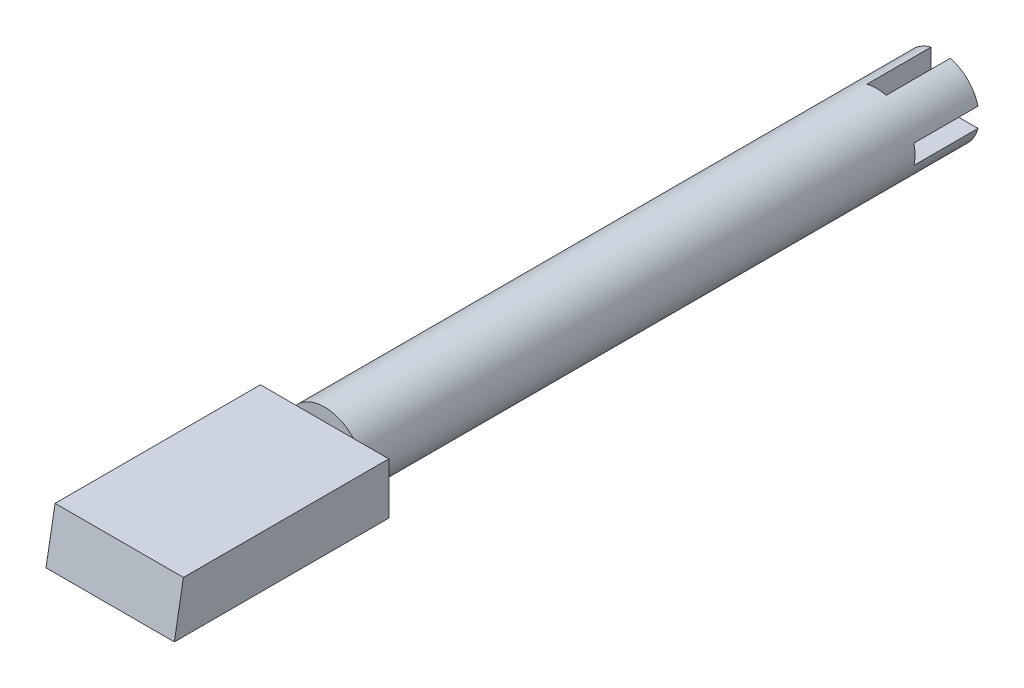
ISO-10303-21;
HEADER;
FILE_DESCRIPTION(('STEP AP214'),'2;1');
FILE_NAME('part.step','',(''),(''),'','','');
FILE_SCHEMA(('AUTOMOTIVE_DESIGN { 1 0 10303 214 1 1 1 1 }'));
ENDSEC;
DATA;
#1=APPLICATION_CONTEXT('core data for automotive mechanical design processes');
#2=APPLICATION_PROTOCOL_DEFINITION('international standard','automotive_design',2000,#1);
#3=PRODUCT_CONTEXT('',#1,'mechanical');
#4=PRODUCT('Part','Part','',(#3));
#5=PRODUCT_RELATED_PRODUCT_CATEGORY('part','',(#4));
#6=PRODUCT_DEFINITION_FORMATION('','',#4);
#7=PRODUCT_DEFINITION_CONTEXT('part definition',#1,'design');
#8=PRODUCT_DEFINITION('design','',#6,#7);
#9=PRODUCT_DEFINITION_SHAPE('','',#8);
#10=(LENGTH_UNIT() NAMED_UNIT(*) SI_UNIT(.MILLI.,.METRE.));
#11=(NAMED_UNIT(*) PLANE_ANGLE_UNIT() SI_UNIT($,.RADIAN.));
#12=(NAMED_UNIT(*) SI_UNIT($,.STERADIAN.) SOLID_ANGLE_UNIT());
#13=UNCERTAINTY_MEASURE_WITH_UNIT(LENGTH_MEASURE(1.E-05),#10,'distance_accuracy_value','');
#14=(GEOMETRIC_REPRESENTATION_CONTEXT(3) GLOBAL_UNCERTAINTY_ASSIGNED_CONTEXT((#13)) GLOBAL_UNIT_ASSIGNED_CONTEXT((#10,
#11,#12)) REPRESENTATION_CONTEXT('',''));
#15=CARTESIAN_POINT('',(0.,0.,0.));
#16=DIRECTION('',(0.,0.,1.));
#17=DIRECTION('',(1.,0.,0.));
#18=AXIS2_PLACEMENT_3D('',#15,#16,#17);
#19=CARTESIAN_POINT('',(0.,0.,48.));
#20=DIRECTION('',(0.,0.,-1.));
#21=DIRECTION('',(-1.,0.,0.));
#22=AXIS2_PLACEMENT_3D('',#19,#20,#21);
#23=CYLINDRICAL_SURFACE('',#22,3.);
#24=CARTESIAN_POINT('',(0.,0.,48.));
#25=DIRECTION('',(0.,0.,1.));
#26=DIRECTION('',(1.,0.,0.));
#27=AXIS2_PLACEMENT_3D('',#24,#25,#26);
#28=CIRCLE('',#27,3.);
#29=CARTESIAN_POINT('',(2.23606797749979,2.,48.));
#30=VERTEX_POINT('',#29);
#31=CARTESIAN_POINT('',(-2.23606797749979,2.,48.));
#32=VERTEX_POINT('',#31);
#33=EDGE_CURVE('E279',#30,#32,#28,.T.);
#34=ORIENTED_EDGE('',*,*,#33,.F.);
#35=CARTESIAN_POINT('',(2.23606797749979,-2.,48.));
#36=VERTEX_POINT('',#35);
#37=EDGE_CURVE('E282',#36,#30,#28,.T.);
#38=ORIENTED_EDGE('',*,*,#37,.F.);
#39=CARTESIAN_POINT('',(-2.23606797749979,-2.,48.));
#40=VERTEX_POINT('',#39);
#41=EDGE_CURVE('E287',#40,#36,#28,.T.);
#42=ORIENTED_EDGE('',*,*,#41,.F.);
#43=EDGE_CURVE('E281',#32,#40,#28,.T.);
#44=ORIENTED_EDGE('',*,*,#43,.F.);
#45=EDGE_LOOP('',(#34,#38,#42,#44));
#46=FACE_BOUND('',#45,.T.);
#47=CARTESIAN_POINT('',(0.,0.,0.));
#48=DIRECTION('',(0.,0.,1.));
#49=DIRECTION('',(1.,0.,0.));
#50=AXIS2_PLACEMENT_3D('',#47,#48,#49);
#51=CIRCLE('',#50,3.);
#52=CARTESIAN_POINT('',(2.90473750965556,0.75,0.));
#53=VERTEX_POINT('',#52);
#54=CARTESIAN_POINT('',(0.750000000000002,2.90473750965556,0.));
#55=VERTEX_POINT('',#54);
#56=EDGE_CURVE('E37',#53,#55,#51,.T.);
#57=ORIENTED_EDGE('',*,*,#56,.T.);
#58=DIRECTION('',(0.,0.,-1.));
#59=VECTOR('',#58,1.);
#60=CARTESIAN_POINT('',(0.750000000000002,2.90473750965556,5.));
#61=LINE('',#60,#59);
#62=CARTESIAN_POINT('',(0.750000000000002,2.90473750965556,5.));
#63=VERTEX_POINT('',#62);
#64=EDGE_CURVE('E227',#63,#55,#61,.T.);
#65=ORIENTED_EDGE('',*,*,#64,.F.);
#66=CARTESIAN_POINT('',(0.,0.,5.));
#67=DIRECTION('',(0.,0.,-1.));
#68=DIRECTION('',(-1.,0.,0.));
#69=AXIS2_PLACEMENT_3D('',#66,#67,#68);
#70=CIRCLE('',#69,3.);
#71=CARTESIAN_POINT('',(-0.750000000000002,2.90473750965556,5.));
#72=VERTEX_POINT('',#71);
#73=EDGE_CURVE('E168',#72,#63,#70,.T.);
#74=ORIENTED_EDGE('',*,*,#73,.F.);
#75=DIRECTION('',(0.,0.,-1.));
#76=VECTOR('',#75,1.);
#77=CARTESIAN_POINT('',(-0.750000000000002,2.90473750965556,5.));
#78=LINE('',#77,#76);
#79=CARTESIAN_POINT('',(-0.750000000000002,2.90473750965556,0.));
#80=VERTEX_POINT('',#79);
#81=EDGE_CURVE('E230',#72,#80,#78,.T.);
#82=ORIENTED_EDGE('',*,*,#81,.T.);
#83=CARTESIAN_POINT('',(-2.90473750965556,0.75,0.));
#84=VERTEX_POINT('',#83);
#85=EDGE_CURVE('E293',#80,#84,#51,.T.);
#86=ORIENTED_EDGE('',*,*,#85,.T.);
#87=DIRECTION('',(0.,0.,-1.));
#88=VECTOR('',#87,1.);
#89=CARTESIAN_POINT('',(-2.90473750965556,0.75,5.));
#90=LINE('',#89,#88);
#91=CARTESIAN_POINT('',(-2.90473750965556,0.75,5.));
#92=VERTEX_POINT('',#91);
#93=EDGE_CURVE('E235',#92,#84,#90,.T.);
#94=ORIENTED_EDGE('',*,*,#93,.F.);
#95=CARTESIAN_POINT('',(0.,0.,5.));
#96=DIRECTION('',(0.,0.,-1.));
#97=DIRECTION('',(-1.,0.,0.));
#98=AXIS2_PLACEMENT_3D('',#95,#96,#97);
#99=CIRCLE('',#98,3.);
#100=CARTESIAN_POINT('',(-2.90473750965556,-0.749999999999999,5.));
#101=VERTEX_POINT('',#100);
#102=EDGE_CURVE('E202',#101,#92,#99,.T.);
#103=ORIENTED_EDGE('',*,*,#102,.F.);
#104=DIRECTION('',(0.,0.,-1.));
#105=VECTOR('',#104,1.);
#106=CARTESIAN_POINT('',(-2.90473750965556,-0.749999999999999,5.));
#107=LINE('',#106,#105);
#108=CARTESIAN_POINT('',(-2.90473750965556,-0.749999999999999,0.));
#109=VERTEX_POINT('',#108);
#110=EDGE_CURVE('E237',#101,#109,#107,.T.);
#111=ORIENTED_EDGE('',*,*,#110,.T.);
#112=CARTESIAN_POINT('',(-0.75,-2.90473750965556,0.));
#113=VERTEX_POINT('',#112);
#114=EDGE_CURVE('E297',#109,#113,#51,.T.);
#115=ORIENTED_EDGE('',*,*,#114,.T.);
#116=DIRECTION('',(0.,0.,-1.));
#117=VECTOR('',#116,1.);
#118=CARTESIAN_POINT('',(-0.75,-2.90473750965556,5.));
#119=LINE('',#118,#117);
#120=CARTESIAN_POINT('',(-0.75,-2.90473750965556,5.));
#121=VERTEX_POINT('',#120);
#122=EDGE_CURVE('E242',#121,#113,#119,.T.);
#123=ORIENTED_EDGE('',*,*,#122,.F.);
#124=CARTESIAN_POINT('',(0.,0.,5.));
#125=DIRECTION('',(0.,0.,-1.));
#126=DIRECTION('',(-1.,0.,0.));
#127=AXIS2_PLACEMENT_3D('',#124,#125,#126);
#128=CIRCLE('',#127,3.);
#129=CARTESIAN_POINT('',(0.750000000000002,-2.90473750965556,5.));
#130=VERTEX_POINT('',#129);
#131=EDGE_CURVE('E195',#130,#121,#128,.T.);
#132=ORIENTED_EDGE('',*,*,#131,.F.);
#133=DIRECTION('',(0.,0.,-1.));
#134=VECTOR('',#133,1.);
#135=CARTESIAN_POINT('',(0.750000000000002,-2.90473750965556,5.));
#136=LINE('',#135,#134);
#137=CARTESIAN_POINT('',(0.750000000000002,-2.90473750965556,0.));
#138=VERTEX_POINT('',#137);
#139=EDGE_CURVE('E244',#130,#138,#136,.T.);
#140=ORIENTED_EDGE('',*,*,#139,.T.);
#141=CARTESIAN_POINT('',(2.90473750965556,-0.75,0.));
#142=VERTEX_POINT('',#141);
#143=EDGE_CURVE('E278',#138,#142,#51,.T.);
#144=ORIENTED_EDGE('',*,*,#143,.T.);
#145=DIRECTION('',(0.,0.,-1.));
#146=VECTOR('',#145,1.);
#147=CARTESIAN_POINT('',(2.90473750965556,-0.75,5.));
#148=LINE('',#147,#146);
#149=CARTESIAN_POINT('',(2.90473750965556,-0.75,5.));
#150=VERTEX_POINT('',#149);
#151=EDGE_CURVE('E249',#150,#142,#148,.T.);
#152=ORIENTED_EDGE('',*,*,#151,.F.);
#153=CARTESIAN_POINT('',(0.,0.,5.));
#154=DIRECTION('',(0.,0.,-1.));
#155=DIRECTION('',(-1.,0.,0.));
#156=AXIS2_PLACEMENT_3D('',#153,#154,#155);
#157=CIRCLE('',#156,3.);
#158=CARTESIAN_POINT('',(2.90473750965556,0.75,5.));
#159=VERTEX_POINT('',#158);
#160=EDGE_CURVE('E177',#159,#150,#157,.T.);
#161=ORIENTED_EDGE('',*,*,#160,.F.);
#162=DIRECTION('',(0.,0.,-1.));
#163=VECTOR('',#162,1.);
#164=CARTESIAN_POINT('',(2.90473750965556,0.75,5.));
#165=LINE('',#164,#163);
#166=EDGE_CURVE('E167',#159,#53,#165,.T.);
#167=ORIENTED_EDGE('',*,*,#166,.T.);
#168=EDGE_LOOP('',(#57,#65,#74,#82,#86,#94,#103,#111,#115,#123,#132,#140,#144,#152,#161,#167));
#169=FACE_BOUND('',#168,.T.);
#170=ADVANCED_FACE('F34',(#46,#169),#23,.T.);
#171=CARTESIAN_POINT('',(0.,0.,0.));
#172=DIRECTION('',(0.,0.,1.));
#173=DIRECTION('',(1.,0.,0.));
#174=AXIS2_PLACEMENT_3D('',#171,#172,#173);
#175=PLANE('',#174);
#176=DIRECTION('',(0.,-1.,0.));
#177=VECTOR('',#176,1.);
#178=CARTESIAN_POINT('',(-0.75,0.,0.));
#179=LINE('',#178,#177);
#180=CARTESIAN_POINT('',(-0.75,0.75,0.));
#181=VERTEX_POINT('',#180);
#182=EDGE_CURVE('E183',#80,#181,#179,.T.);
#183=ORIENTED_EDGE('',*,*,#182,.T.);
#184=DIRECTION('',(1.,0.,0.));
#185=VECTOR('',#184,1.);
#186=CARTESIAN_POINT('',(0.,0.75,0.));
#187=LINE('',#186,#185);
#188=EDGE_CURVE('E186',#84,#181,#187,.T.);
#189=ORIENTED_EDGE('',*,*,#188,.F.);
#190=ORIENTED_EDGE('',*,*,#85,.F.);
#191=EDGE_LOOP('',(#183,#189,#190));
#192=FACE_BOUND('',#191,.T.);
#193=ADVANCED_FACE('F334',(#192),#175,.F.);
#194=DIRECTION('',(1.,0.,0.));
#195=VECTOR('',#194,1.);
#196=CARTESIAN_POINT('',(0.,-0.75,0.));
#197=LINE('',#196,#195);
#198=CARTESIAN_POINT('',(-0.75,-0.75,0.));
#199=VERTEX_POINT('',#198);
#200=EDGE_CURVE('E222',#109,#199,#197,.T.);
#201=ORIENTED_EDGE('',*,*,#200,.T.);
#202=DIRECTION('',(0.,-1.,0.));
#203=VECTOR('',#202,1.);
#204=CARTESIAN_POINT('',(-0.75,0.,0.));
#205=LINE('',#204,#203);
#206=EDGE_CURVE('E219',#199,#113,#205,.T.);
#207=ORIENTED_EDGE('',*,*,#206,.T.);
#208=ORIENTED_EDGE('',*,*,#114,.F.);
#209=EDGE_LOOP('',(#201,#207,#208));
#210=FACE_BOUND('',#209,.T.);
#211=ADVANCED_FACE('F307',(#210),#175,.F.);
#212=ORIENTED_EDGE('',*,*,#143,.F.);
#213=DIRECTION('',(0.,-1.,0.));
#214=VECTOR('',#213,1.);
#215=CARTESIAN_POINT('',(0.75,0.,0.));
#216=LINE('',#215,#214);
#217=CARTESIAN_POINT('',(0.75,-0.75,0.));
#218=VERTEX_POINT('',#217);
#219=EDGE_CURVE('E217',#218,#138,#216,.T.);
#220=ORIENTED_EDGE('',*,*,#219,.F.);
#221=DIRECTION('',(1.,0.,0.));
#222=VECTOR('',#221,1.);
#223=CARTESIAN_POINT('',(0.,-0.75,0.));
#224=LINE('',#223,#222);
#225=EDGE_CURVE('E214',#218,#142,#224,.T.);
#226=ORIENTED_EDGE('',*,*,#225,.T.);
#227=EDGE_LOOP('',(#212,#220,#226));
#228=FACE_BOUND('',#227,.T.);
#229=ADVANCED_FACE('F319',(#228),#175,.F.);
#230=CARTESIAN_POINT('',(0.,0.,48.));
#231=DIRECTION('',(0.,0.,1.));
#232=DIRECTION('',(1.,0.,0.));
#233=AXIS2_PLACEMENT_3D('',#230,#231,#232);
#234=PLANE('',#233);
#235=ORIENTED_EDGE('',*,*,#41,.T.);
#236=DIRECTION('',(-1.,0.,0.));
#237=VECTOR('',#236,1.);
#238=CARTESIAN_POINT('',(5.,-2.,48.));
#239=LINE('',#238,#237);
#240=EDGE_CURVE('E42',#36,#40,#239,.T.);
#241=ORIENTED_EDGE('',*,*,#240,.T.);
#242=EDGE_LOOP('',(#235,#241));
#243=FACE_BOUND('',#242,.T.);
#244=ADVANCED_FACE('F346',(#243),#234,.T.);
#245=DIRECTION('',(-1.,0.,0.));
#246=VECTOR('',#245,1.);
#247=CARTESIAN_POINT('',(5.,2.,48.));
#248=LINE('',#247,#246);
#249=EDGE_CURVE('E11',#30,#32,#248,.T.);
#250=ORIENTED_EDGE('',*,*,#249,.F.);
#251=ORIENTED_EDGE('',*,*,#33,.T.);
#252=EDGE_LOOP('',(#250,#251));
#253=FACE_BOUND('',#252,.T.);
#254=ADVANCED_FACE('F379',(#253),#234,.T.);
#255=DIRECTION('',(1.,0.,0.));
#256=VECTOR('',#255,1.);
#257=CARTESIAN_POINT('',(0.,0.75,0.));
#258=LINE('',#257,#256);
#259=CARTESIAN_POINT('',(0.75,0.75,0.));
#260=VERTEX_POINT('',#259);
#261=EDGE_CURVE('E212',#260,#53,#258,.T.);
#262=ORIENTED_EDGE('',*,*,#261,.F.);
#263=DIRECTION('',(0.,-1.,0.));
#264=VECTOR('',#263,1.);
#265=CARTESIAN_POINT('',(0.75,0.,0.));
#266=LINE('',#265,#264);
#267=EDGE_CURVE('E52',#55,#260,#266,.T.);
#268=ORIENTED_EDGE('',*,*,#267,.F.);
#269=ORIENTED_EDGE('',*,*,#56,.F.);
#270=EDGE_LOOP('',(#262,#268,#269));
#271=FACE_BOUND('',#270,.T.);
#272=ADVANCED_FACE('F340',(#271),#175,.F.);
#273=CARTESIAN_POINT('',(5.,-2.,48.));
#274=DIRECTION('',(0.,0.,1.));
#275=DIRECTION('',(1.,0.,0.));
#276=AXIS2_PLACEMENT_3D('',#273,#274,#275);
#277=PLANE('',#276);
#278=CARTESIAN_POINT('',(-5.,2.,48.));
#279=VERTEX_POINT('',#278);
#280=EDGE_CURVE('E45',#32,#279,#248,.T.);
#281=ORIENTED_EDGE('',*,*,#280,.F.);
#282=ORIENTED_EDGE('',*,*,#43,.T.);
#283=CARTESIAN_POINT('',(-5.,-2.,48.));
#284=VERTEX_POINT('',#283);
#285=EDGE_CURVE('E60',#40,#284,#239,.T.);
#286=ORIENTED_EDGE('',*,*,#285,.T.);
#287=DIRECTION('',(0.,1.,0.));
#288=VECTOR('',#287,1.);
#289=CARTESIAN_POINT('',(-5.,-2.,48.));
#290=LINE('',#289,#288);
#291=EDGE_CURVE('E229',#284,#279,#290,.T.);
#292=ORIENTED_EDGE('',*,*,#291,.T.);
#293=EDGE_LOOP('',(#281,#282,#286,#292));
#294=FACE_BOUND('',#293,.T.);
#295=ADVANCED_FACE('F344',(#294),#277,.F.);
#296=CARTESIAN_POINT('',(5.,-2.,48.));
#297=VERTEX_POINT('',#296);
#298=EDGE_CURVE('E269',#297,#36,#239,.T.);
#299=ORIENTED_EDGE('',*,*,#298,.T.);
#300=ORIENTED_EDGE('',*,*,#37,.T.);
#301=CARTESIAN_POINT('',(5.,2.,48.));
#302=VERTEX_POINT('',#301);
#303=EDGE_CURVE('E44',#302,#30,#248,.T.);
#304=ORIENTED_EDGE('',*,*,#303,.F.);
#305=DIRECTION('',(0.,1.,0.));
#306=VECTOR('',#305,1.);
#307=CARTESIAN_POINT('',(5.,-2.,48.));
#308=LINE('',#307,#306);
#309=EDGE_CURVE('E252',#297,#302,#308,.T.);
#310=ORIENTED_EDGE('',*,*,#309,.F.);
#311=EDGE_LOOP('',(#299,#300,#304,#310));
#312=FACE_BOUND('',#311,.T.);
#313=ADVANCED_FACE('F351',(#312),#277,.F.);
#314=CARTESIAN_POINT('',(5.,2.,48.));
#315=DIRECTION('',(0.,-1.,0.));
#316=DIRECTION('',(0.,0.,-1.));
#317=AXIS2_PLACEMENT_3D('',#314,#315,#316);
#318=PLANE('',#317);
#319=DIRECTION('',(0.,0.,1.));
#320=VECTOR('',#319,1.);
#321=CARTESIAN_POINT('',(-5.,2.,48.));
#322=LINE('',#321,#320);
#323=CARTESIAN_POINT('',(-5.,2.,64.));
#324=VERTEX_POINT('',#323);
#325=EDGE_CURVE('E264',#279,#324,#322,.T.);
#326=ORIENTED_EDGE('',*,*,#325,.T.);
#327=DIRECTION('',(-1.,0.,0.));
#328=VECTOR('',#327,1.);
#329=CARTESIAN_POINT('',(5.,2.,64.));
#330=LINE('',#329,#328);
#331=CARTESIAN_POINT('',(5.,2.,64.));
#332=VERTEX_POINT('',#331);
#333=EDGE_CURVE('E275',#332,#324,#330,.T.);
#334=ORIENTED_EDGE('',*,*,#333,.F.);
#335=DIRECTION('',(0.,0.,1.));
#336=VECTOR('',#335,1.);
#337=CARTESIAN_POINT('',(5.,2.,48.));
#338=LINE('',#337,#336);
#339=EDGE_CURVE('E255',#302,#332,#338,.T.);
#340=ORIENTED_EDGE('',*,*,#339,.F.);
#341=ORIENTED_EDGE('',*,*,#303,.T.);
#342=ORIENTED_EDGE('',*,*,#249,.T.);
#343=ORIENTED_EDGE('',*,*,#280,.T.);
#344=EDGE_LOOP('',(#326,#334,#340,#341,#342,#343));
#345=FACE_BOUND('',#344,.T.);
#346=ADVANCED_FACE('F365',(#345),#318,.F.);
#347=CARTESIAN_POINT('',(5.,2.,64.));
#348=DIRECTION('',(0.,-0.173648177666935,-0.984807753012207));
#349=DIRECTION('',(0.,0.984807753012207,-0.173648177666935));
#350=AXIS2_PLACEMENT_3D('',#347,#348,#349);
#351=PLANE('',#350);
#352=DIRECTION('',(0.,-0.984807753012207,0.173648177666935));
#353=VECTOR('',#352,1.);
#354=CARTESIAN_POINT('',(-5.,2.,64.));
#355=LINE('',#354,#353);
#356=CARTESIAN_POINT('',(-5.,-2.,64.7053079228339));
#357=VERTEX_POINT('',#356);
#358=EDGE_CURVE('E266',#324,#357,#355,.T.);
#359=ORIENTED_EDGE('',*,*,#358,.T.);
#360=DIRECTION('',(-1.,0.,0.));
#361=VECTOR('',#360,1.);
#362=CARTESIAN_POINT('',(5.,-2.,64.7053079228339));
#363=LINE('',#362,#361);
#364=CARTESIAN_POINT('',(5.,-2.,64.7053079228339));
#365=VERTEX_POINT('',#364);
#366=EDGE_CURVE('E272',#365,#357,#363,.T.);
#367=ORIENTED_EDGE('',*,*,#366,.F.);
#368=DIRECTION('',(0.,-0.984807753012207,0.173648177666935));
#369=VECTOR('',#368,1.);
#370=CARTESIAN_POINT('',(5.,2.,64.));
#371=LINE('',#370,#369);
#372=EDGE_CURVE('E258',#332,#365,#371,.T.);
#373=ORIENTED_EDGE('',*,*,#372,.F.);
#374=ORIENTED_EDGE('',*,*,#333,.T.);
#375=EDGE_LOOP('',(#359,#367,#373,#374));
#376=FACE_BOUND('',#375,.T.);
#377=ADVANCED_FACE('F366',(#376),#351,.F.);
#378=CARTESIAN_POINT('',(5.,-2.,64.7053079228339));
#379=DIRECTION('',(0.,1.,0.));
#380=DIRECTION('',(0.,0.,1.));
#381=AXIS2_PLACEMENT_3D('',#378,#379,#380);
#382=PLANE('',#381);
#383=DIRECTION('',(0.,0.,-1.));
#384=VECTOR('',#383,1.);
#385=CARTESIAN_POINT('',(-5.,-2.,64.7053079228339));
#386=LINE('',#385,#384);
#387=EDGE_CURVE('E256',#357,#284,#386,.T.);
#388=ORIENTED_EDGE('',*,*,#387,.T.);
#389=ORIENTED_EDGE('',*,*,#285,.F.);
#390=ORIENTED_EDGE('',*,*,#240,.F.);
#391=ORIENTED_EDGE('',*,*,#298,.F.);
#392=DIRECTION('',(0.,0.,-1.));
#393=VECTOR('',#392,1.);
#394=CARTESIAN_POINT('',(5.,-2.,64.7053079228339));
#395=LINE('',#394,#393);
#396=EDGE_CURVE('E260',#365,#297,#395,.T.);
#397=ORIENTED_EDGE('',*,*,#396,.F.);
#398=ORIENTED_EDGE('',*,*,#366,.T.);
#399=EDGE_LOOP('',(#388,#389,#390,#391,#397,#398));
#400=FACE_BOUND('',#399,.T.);
#401=ADVANCED_FACE('F348',(#400),#382,.F.);
#402=CARTESIAN_POINT('',(5.,0.,0.));
#403=DIRECTION('',(1.,0.,0.));
#404=DIRECTION('',(0.,0.,-1.));
#405=AXIS2_PLACEMENT_3D('',#402,#403,#404);
#406=PLANE('',#405);
#407=ORIENTED_EDGE('',*,*,#309,.T.);
#408=ORIENTED_EDGE('',*,*,#339,.T.);
#409=ORIENTED_EDGE('',*,*,#372,.T.);
#410=ORIENTED_EDGE('',*,*,#396,.T.);
#411=EDGE_LOOP('',(#407,#408,#409,#410));
#412=FACE_BOUND('',#411,.T.);
#413=ADVANCED_FACE('F353',(#412),#406,.T.);
#414=CARTESIAN_POINT('',(-5.,0.,0.));
#415=DIRECTION('',(1.,0.,0.));
#416=DIRECTION('',(0.,0.,-1.));
#417=AXIS2_PLACEMENT_3D('',#414,#415,#416);
#418=PLANE('',#417);
#419=ORIENTED_EDGE('',*,*,#291,.F.);
#420=ORIENTED_EDGE('',*,*,#387,.F.);
#421=ORIENTED_EDGE('',*,*,#358,.F.);
#422=ORIENTED_EDGE('',*,*,#325,.F.);
#423=EDGE_LOOP('',(#419,#420,#421,#422));
#424=FACE_BOUND('',#423,.T.);
#425=ADVANCED_FACE('F362',(#424),#418,.F.);
#426=CARTESIAN_POINT('',(0.75,0.,5.));
#427=DIRECTION('',(1.,0.,0.));
#428=DIRECTION('',(0.,0.,-1.));
#429=AXIS2_PLACEMENT_3D('',#426,#427,#428);
#430=PLANE('',#429);
#431=ORIENTED_EDGE('',*,*,#267,.T.);
#432=DIRECTION('',(0.,0.,-1.));
#433=VECTOR('',#432,1.);
#434=CARTESIAN_POINT('',(0.75,0.75,5.));
#435=LINE('',#434,#433);
#436=CARTESIAN_POINT('',(0.75,0.75,5.));
#437=VERTEX_POINT('',#436);
#438=EDGE_CURVE('E159',#437,#260,#435,.T.);
#439=ORIENTED_EDGE('',*,*,#438,.F.);
#440=DIRECTION('',(0.,-1.,0.));
#441=VECTOR('',#440,1.);
#442=CARTESIAN_POINT('',(0.75,0.,5.));
#443=LINE('',#442,#441);
#444=EDGE_CURVE('E163',#63,#437,#443,.T.);
#445=ORIENTED_EDGE('',*,*,#444,.F.);
#446=ORIENTED_EDGE('',*,*,#64,.T.);
#447=EDGE_LOOP('',(#431,#439,#445,#446));
#448=FACE_BOUND('',#447,.T.);
#449=ADVANCED_FACE('F161',(#448),#430,.F.);
#450=CARTESIAN_POINT('',(-0.75,0.,5.));
#451=DIRECTION('',(1.,0.,0.));
#452=DIRECTION('',(0.,0.,-1.));
#453=AXIS2_PLACEMENT_3D('',#450,#451,#452);
#454=PLANE('',#453);
#455=ORIENTED_EDGE('',*,*,#182,.F.);
#456=ORIENTED_EDGE('',*,*,#81,.F.);
#457=DIRECTION('',(0.,-1.,0.));
#458=VECTOR('',#457,1.);
#459=CARTESIAN_POINT('',(-0.75,0.,5.));
#460=LINE('',#459,#458);
#461=CARTESIAN_POINT('',(-0.75,0.75,5.));
#462=VERTEX_POINT('',#461);
#463=EDGE_CURVE('E208',#72,#462,#460,.T.);
#464=ORIENTED_EDGE('',*,*,#463,.T.);
#465=DIRECTION('',(0.,0.,-1.));
#466=VECTOR('',#465,1.);
#467=CARTESIAN_POINT('',(-0.75,0.75,5.));
#468=LINE('',#467,#466);
#469=EDGE_CURVE('E233',#462,#181,#468,.T.);
#470=ORIENTED_EDGE('',*,*,#469,.T.);
#471=EDGE_LOOP('',(#455,#456,#464,#470));
#472=FACE_BOUND('',#471,.T.);
#473=ADVANCED_FACE('F471',(#472),#454,.T.);
#474=CARTESIAN_POINT('',(0.,0.75,5.));
#475=DIRECTION('',(0.,1.,0.));
#476=DIRECTION('',(0.,0.,1.));
#477=AXIS2_PLACEMENT_3D('',#474,#475,#476);
#478=PLANE('',#477);
#479=ORIENTED_EDGE('',*,*,#188,.T.);
#480=ORIENTED_EDGE('',*,*,#469,.F.);
#481=DIRECTION('',(1.,0.,0.));
#482=VECTOR('',#481,1.);
#483=CARTESIAN_POINT('',(0.,0.75,5.));
#484=LINE('',#483,#482);
#485=EDGE_CURVE('E205',#92,#462,#484,.T.);
#486=ORIENTED_EDGE('',*,*,#485,.F.);
#487=ORIENTED_EDGE('',*,*,#93,.T.);
#488=EDGE_LOOP('',(#479,#480,#486,#487));
#489=FACE_BOUND('',#488,.T.);
#490=ADVANCED_FACE('F480',(#489),#478,.F.);
#491=CARTESIAN_POINT('',(0.,-0.75,5.));
#492=DIRECTION('',(0.,1.,0.));
#493=DIRECTION('',(0.,0.,1.));
#494=AXIS2_PLACEMENT_3D('',#491,#492,#493);
#495=PLANE('',#494);
#496=ORIENTED_EDGE('',*,*,#200,.F.);
#497=ORIENTED_EDGE('',*,*,#110,.F.);
#498=DIRECTION('',(1.,0.,0.));
#499=VECTOR('',#498,1.);
#500=CARTESIAN_POINT('',(0.,-0.75,5.));
#501=LINE('',#500,#499);
#502=CARTESIAN_POINT('',(-0.75,-0.75,5.));
#503=VERTEX_POINT('',#502);
#504=EDGE_CURVE('E200',#101,#503,#501,.T.);
#505=ORIENTED_EDGE('',*,*,#504,.T.);
#506=DIRECTION('',(0.,0.,-1.));
#507=VECTOR('',#506,1.);
#508=CARTESIAN_POINT('',(-0.75,-0.75,5.));
#509=LINE('',#508,#507);
#510=EDGE_CURVE('E240',#503,#199,#509,.T.);
#511=ORIENTED_EDGE('',*,*,#510,.T.);
#512=EDGE_LOOP('',(#496,#497,#505,#511));
#513=FACE_BOUND('',#512,.T.);
#514=ADVANCED_FACE('F331',(#513),#495,.T.);
#515=CARTESIAN_POINT('',(-0.75,0.,5.));
#516=DIRECTION('',(1.,0.,0.));
#517=DIRECTION('',(0.,0.,-1.));
#518=AXIS2_PLACEMENT_3D('',#515,#516,#517);
#519=PLANE('',#518);
#520=ORIENTED_EDGE('',*,*,#206,.F.);
#521=ORIENTED_EDGE('',*,*,#510,.F.);
#522=DIRECTION('',(0.,-1.,0.));
#523=VECTOR('',#522,1.);
#524=CARTESIAN_POINT('',(-0.75,0.,5.));
#525=LINE('',#524,#523);
#526=EDGE_CURVE('E198',#503,#121,#525,.T.);
#527=ORIENTED_EDGE('',*,*,#526,.T.);
#528=ORIENTED_EDGE('',*,*,#122,.T.);
#529=EDGE_LOOP('',(#520,#521,#527,#528));
#530=FACE_BOUND('',#529,.T.);
#531=ADVANCED_FACE('F311',(#530),#519,.T.);
#532=CARTESIAN_POINT('',(0.75,0.,5.));
#533=DIRECTION('',(1.,0.,0.));
#534=DIRECTION('',(0.,0.,-1.));
#535=AXIS2_PLACEMENT_3D('',#532,#533,#534);
#536=PLANE('',#535);
#537=ORIENTED_EDGE('',*,*,#219,.T.);
#538=ORIENTED_EDGE('',*,*,#139,.F.);
#539=DIRECTION('',(0.,-1.,0.));
#540=VECTOR('',#539,1.);
#541=CARTESIAN_POINT('',(0.75,0.,5.));
#542=LINE('',#541,#540);
#543=CARTESIAN_POINT('',(0.75,-0.75,5.));
#544=VERTEX_POINT('',#543);
#545=EDGE_CURVE('E192',#544,#130,#542,.T.);
#546=ORIENTED_EDGE('',*,*,#545,.F.);
#547=DIRECTION('',(0.,0.,-1.));
#548=VECTOR('',#547,1.);
#549=CARTESIAN_POINT('',(0.75,-0.75,5.));
#550=LINE('',#549,#548);
#551=EDGE_CURVE('E247',#544,#218,#550,.T.);
#552=ORIENTED_EDGE('',*,*,#551,.T.);
#553=EDGE_LOOP('',(#537,#538,#546,#552));
#554=FACE_BOUND('',#553,.T.);
#555=ADVANCED_FACE('F323',(#554),#536,.F.);
#556=CARTESIAN_POINT('',(0.,-0.75,5.));
#557=DIRECTION('',(0.,1.,0.));
#558=DIRECTION('',(0.,0.,1.));
#559=AXIS2_PLACEMENT_3D('',#556,#557,#558);
#560=PLANE('',#559);
#561=ORIENTED_EDGE('',*,*,#225,.F.);
#562=ORIENTED_EDGE('',*,*,#551,.F.);
#563=DIRECTION('',(1.,0.,0.));
#564=VECTOR('',#563,1.);
#565=CARTESIAN_POINT('',(0.,-0.75,5.));
#566=LINE('',#565,#564);
#567=EDGE_CURVE('E190',#544,#150,#566,.T.);
#568=ORIENTED_EDGE('',*,*,#567,.T.);
#569=ORIENTED_EDGE('',*,*,#151,.T.);
#570=EDGE_LOOP('',(#561,#562,#568,#569));
#571=FACE_BOUND('',#570,.T.);
#572=ADVANCED_FACE('F322',(#571),#560,.T.);
#573=CARTESIAN_POINT('',(0.,0.75,5.));
#574=DIRECTION('',(0.,1.,0.));
#575=DIRECTION('',(0.,0.,1.));
#576=AXIS2_PLACEMENT_3D('',#573,#574,#575);
#577=PLANE('',#576);
#578=ORIENTED_EDGE('',*,*,#261,.T.);
#579=ORIENTED_EDGE('',*,*,#166,.F.);
#580=DIRECTION('',(1.,0.,0.));
#581=VECTOR('',#580,1.);
#582=CARTESIAN_POINT('',(0.,0.75,5.));
#583=LINE('',#582,#581);
#584=EDGE_CURVE('E171',#437,#159,#583,.T.);
#585=ORIENTED_EDGE('',*,*,#584,.F.);
#586=ORIENTED_EDGE('',*,*,#438,.T.);
#587=EDGE_LOOP('',(#578,#579,#585,#586));
#588=FACE_BOUND('',#587,.T.);
#589=ADVANCED_FACE('F172',(#588),#577,.F.);
#590=CARTESIAN_POINT('',(0.,0.,5.));
#591=DIRECTION('',(0.,0.,-1.));
#592=DIRECTION('',(-1.,0.,0.));
#593=AXIS2_PLACEMENT_3D('',#590,#591,#592);
#594=PLANE('',#593);
#595=ORIENTED_EDGE('',*,*,#444,.T.);
#596=ORIENTED_EDGE('',*,*,#584,.T.);
#597=ORIENTED_EDGE('',*,*,#160,.T.);
#598=ORIENTED_EDGE('',*,*,#567,.F.);
#599=ORIENTED_EDGE('',*,*,#545,.T.);
#600=ORIENTED_EDGE('',*,*,#131,.T.);
#601=ORIENTED_EDGE('',*,*,#526,.F.);
#602=ORIENTED_EDGE('',*,*,#504,.F.);
#603=ORIENTED_EDGE('',*,*,#102,.T.);
#604=ORIENTED_EDGE('',*,*,#485,.T.);
#605=ORIENTED_EDGE('',*,*,#463,.F.);
#606=ORIENTED_EDGE('',*,*,#73,.T.);
#607=EDGE_LOOP('',(#595,#596,#597,#598,#599,#600,#601,#602,#603,#604,#605,#606));
#608=FACE_BOUND('',#607,.T.);
#609=ADVANCED_FACE('F179',(#608),#594,.T.);
#610=CLOSED_SHELL('',(#170,#193,#211,#229,#244,#254,#272,#295,#313,#346,#377,#401,#413,#425,
#449,#473,#490,#514,#531,#555,#572,#589,#609));
#611=MANIFOLD_SOLID_BREP('B2',#610);
#612=ADVANCED_BREP_SHAPE_REPRESENTATION('',(#18,#611),#14);
#613=SHAPE_DEFINITION_REPRESENTATION(#9,#612);
ENDSEC;
END-ISO-10303-21;
